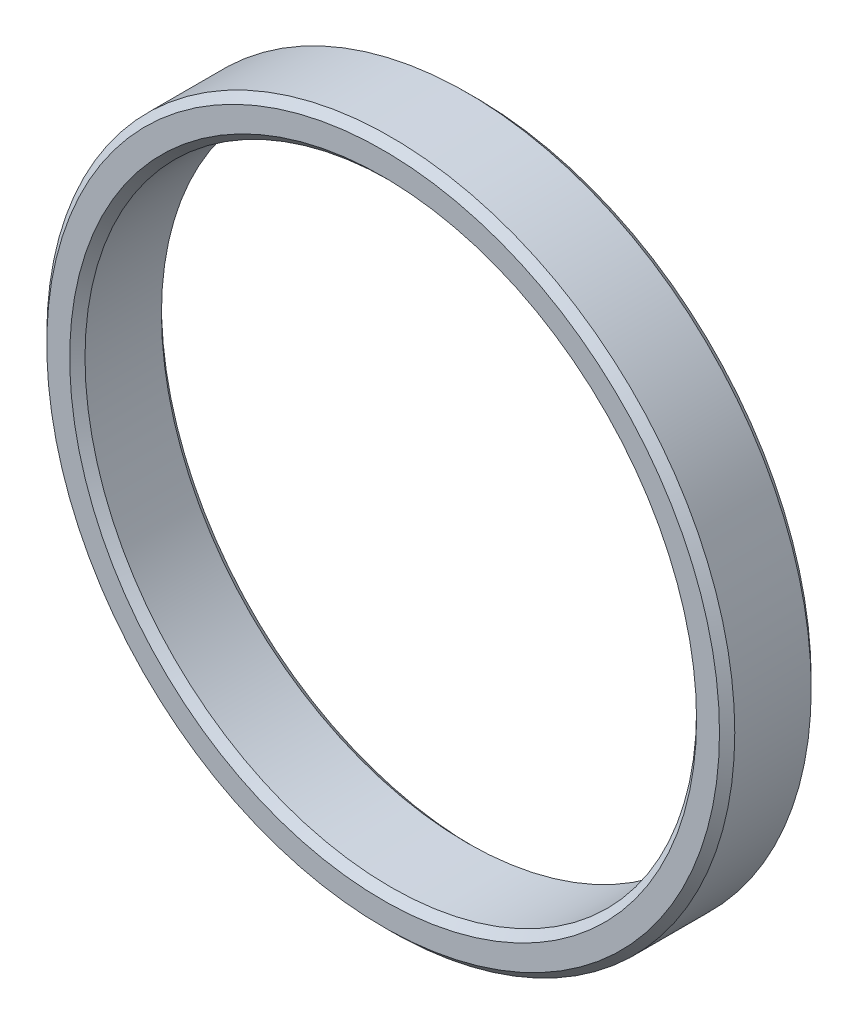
from build123d import *

# Parameters (mm, degrees)
ESQUISSE1_R          = 22.5
ESQUISSE1_R_2        = 20
BASE_EXTRUSION_DEPTH = 6
CHANFREIN1_SIZE      = 0.5


with BuildPart() as part:
    # Esquisse1 → Base-Extrusion (new body)
    with BuildSketch(Plane.XY):
        Circle(ESQUISSE1_R)
        Circle(ESQUISSE1_R_2, mode=Mode.SUBTRACT)
    extrude(amount=BASE_EXTRUSION_DEPTH)

    # Chanfrein1
    chanfrein1_edges = [part.edges().sort_by_distance(p)[0] for p in [
        (-22.5, 0, 0),
        (-22.5, 0, 6),
        (-20, 0, 0),
        (-20, 0, 6),
    ]]
    chamfer(chanfrein1_edges, length=CHANFREIN1_SIZE)


solid = part.part
